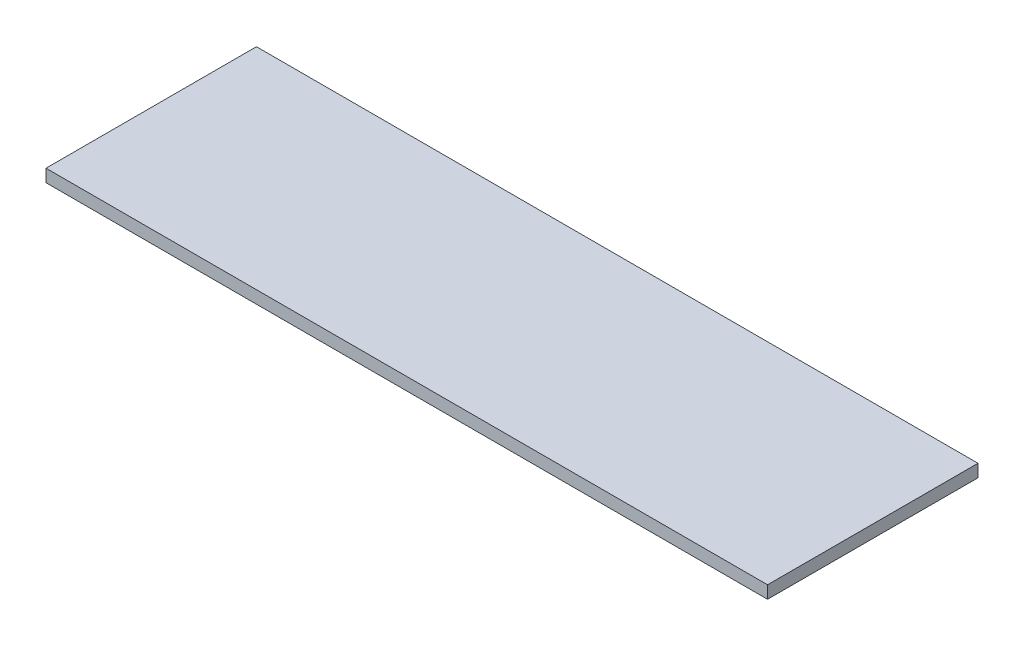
ISO-10303-21;
HEADER;
FILE_DESCRIPTION(('STEP AP214'),'2;1');
FILE_NAME('part.step','',(''),(''),'','','');
FILE_SCHEMA(('AUTOMOTIVE_DESIGN { 1 0 10303 214 1 1 1 1 }'));
ENDSEC;
DATA;
#1=APPLICATION_CONTEXT('core data for automotive mechanical design processes');
#2=APPLICATION_PROTOCOL_DEFINITION('international standard','automotive_design',2000,#1);
#3=PRODUCT_CONTEXT('',#1,'mechanical');
#4=PRODUCT('Part','Part','',(#3));
#5=PRODUCT_RELATED_PRODUCT_CATEGORY('part','',(#4));
#6=PRODUCT_DEFINITION_FORMATION('','',#4);
#7=PRODUCT_DEFINITION_CONTEXT('part definition',#1,'design');
#8=PRODUCT_DEFINITION('design','',#6,#7);
#9=PRODUCT_DEFINITION_SHAPE('','',#8);
#10=(LENGTH_UNIT() NAMED_UNIT(*) SI_UNIT(.MILLI.,.METRE.));
#11=(NAMED_UNIT(*) PLANE_ANGLE_UNIT() SI_UNIT($,.RADIAN.));
#12=(NAMED_UNIT(*) SI_UNIT($,.STERADIAN.) SOLID_ANGLE_UNIT());
#13=UNCERTAINTY_MEASURE_WITH_UNIT(LENGTH_MEASURE(1.E-05),#10,'distance_accuracy_value','');
#14=(GEOMETRIC_REPRESENTATION_CONTEXT(3) GLOBAL_UNCERTAINTY_ASSIGNED_CONTEXT((#13)) GLOBAL_UNIT_ASSIGNED_CONTEXT((#10,
#11,#12)) REPRESENTATION_CONTEXT('',''));
#15=CARTESIAN_POINT('',(0.,0.,0.));
#16=DIRECTION('',(0.,0.,1.));
#17=DIRECTION('',(1.,0.,0.));
#18=AXIS2_PLACEMENT_3D('',#15,#16,#17);
#19=CARTESIAN_POINT('',(-76.2,2.65684,-22.225));
#20=DIRECTION('',(1.,0.,0.));
#21=DIRECTION('',(0.,0.,-1.));
#22=AXIS2_PLACEMENT_3D('',#19,#20,#21);
#23=PLANE('',#22);
#24=DIRECTION('',(0.,0.,1.));
#25=VECTOR('',#24,1.);
#26=CARTESIAN_POINT('',(-76.2,0.,-22.225));
#27=LINE('',#26,#25);
#28=CARTESIAN_POINT('',(-76.2,0.,-22.225));
#29=VERTEX_POINT('',#28);
#30=CARTESIAN_POINT('',(-76.2,0.,22.225));
#31=VERTEX_POINT('',#30);
#32=EDGE_CURVE('E96',#29,#31,#27,.T.);
#33=ORIENTED_EDGE('',*,*,#32,.T.);
#34=DIRECTION('',(0.,-1.,0.));
#35=VECTOR('',#34,1.);
#36=CARTESIAN_POINT('',(-76.2,2.65684,22.225));
#37=LINE('',#36,#35);
#38=CARTESIAN_POINT('',(-76.2,2.65684,22.225));
#39=VERTEX_POINT('',#38);
#40=EDGE_CURVE('E11',#39,#31,#37,.T.);
#41=ORIENTED_EDGE('',*,*,#40,.F.);
#42=DIRECTION('',(0.,0.,1.));
#43=VECTOR('',#42,1.);
#44=CARTESIAN_POINT('',(-76.2,2.65684,-22.225));
#45=LINE('',#44,#43);
#46=CARTESIAN_POINT('',(-76.2,2.65684,-22.225));
#47=VERTEX_POINT('',#46);
#48=EDGE_CURVE('E84',#47,#39,#45,.T.);
#49=ORIENTED_EDGE('',*,*,#48,.F.);
#50=DIRECTION('',(0.,-1.,0.));
#51=VECTOR('',#50,1.);
#52=CARTESIAN_POINT('',(-76.2,2.65684,-22.225));
#53=LINE('',#52,#51);
#54=EDGE_CURVE('E92',#47,#29,#53,.T.);
#55=ORIENTED_EDGE('',*,*,#54,.T.);
#56=EDGE_LOOP('',(#33,#41,#49,#55));
#57=FACE_BOUND('',#56,.T.);
#58=ADVANCED_FACE('F33',(#57),#23,.F.);
#59=CARTESIAN_POINT('',(-76.2,2.65684,22.225));
#60=DIRECTION('',(0.,0.,-1.));
#61=DIRECTION('',(-1.,0.,0.));
#62=AXIS2_PLACEMENT_3D('',#59,#60,#61);
#63=PLANE('',#62);
#64=DIRECTION('',(1.,0.,0.));
#65=VECTOR('',#64,1.);
#66=CARTESIAN_POINT('',(-76.2,0.,22.225));
#67=LINE('',#66,#65);
#68=CARTESIAN_POINT('',(76.2,0.,22.225));
#69=VERTEX_POINT('',#68);
#70=EDGE_CURVE('E88',#31,#69,#67,.T.);
#71=ORIENTED_EDGE('',*,*,#70,.T.);
#72=DIRECTION('',(0.,-1.,0.));
#73=VECTOR('',#72,1.);
#74=CARTESIAN_POINT('',(76.2,2.65684,22.225));
#75=LINE('',#74,#73);
#76=CARTESIAN_POINT('',(76.2,2.65684,22.225));
#77=VERTEX_POINT('',#76);
#78=EDGE_CURVE('E41',#77,#69,#75,.T.);
#79=ORIENTED_EDGE('',*,*,#78,.F.);
#80=DIRECTION('',(1.,0.,0.));
#81=VECTOR('',#80,1.);
#82=CARTESIAN_POINT('',(-76.2,2.65684,22.225));
#83=LINE('',#82,#81);
#84=EDGE_CURVE('E79',#39,#77,#83,.T.);
#85=ORIENTED_EDGE('',*,*,#84,.F.);
#86=ORIENTED_EDGE('',*,*,#40,.T.);
#87=EDGE_LOOP('',(#71,#79,#85,#86));
#88=FACE_BOUND('',#87,.T.);
#89=ADVANCED_FACE('F87',(#88),#63,.F.);
#90=CARTESIAN_POINT('',(76.2,2.65684,-22.225));
#91=DIRECTION('',(-1.,0.,0.));
#92=DIRECTION('',(0.,0.,1.));
#93=AXIS2_PLACEMENT_3D('',#90,#91,#92);
#94=PLANE('',#93);
#95=DIRECTION('',(0.,0.,-1.));
#96=VECTOR('',#95,1.);
#97=CARTESIAN_POINT('',(76.2,0.,-22.225));
#98=LINE('',#97,#96);
#99=CARTESIAN_POINT('',(76.2,0.,-22.225));
#100=VERTEX_POINT('',#99);
#101=EDGE_CURVE('E66',#69,#100,#98,.T.);
#102=ORIENTED_EDGE('',*,*,#101,.T.);
#103=DIRECTION('',(0.,-1.,0.));
#104=VECTOR('',#103,1.);
#105=CARTESIAN_POINT('',(76.2,2.65684,-22.225));
#106=LINE('',#105,#104);
#107=CARTESIAN_POINT('',(76.2,2.65684,-22.225));
#108=VERTEX_POINT('',#107);
#109=EDGE_CURVE('E89',#108,#100,#106,.T.);
#110=ORIENTED_EDGE('',*,*,#109,.F.);
#111=DIRECTION('',(0.,0.,-1.));
#112=VECTOR('',#111,1.);
#113=CARTESIAN_POINT('',(76.2,2.65684,-22.225));
#114=LINE('',#113,#112);
#115=EDGE_CURVE('E82',#77,#108,#114,.T.);
#116=ORIENTED_EDGE('',*,*,#115,.F.);
#117=ORIENTED_EDGE('',*,*,#78,.T.);
#118=EDGE_LOOP('',(#102,#110,#116,#117));
#119=FACE_BOUND('',#118,.T.);
#120=ADVANCED_FACE('F90',(#119),#94,.F.);
#121=CARTESIAN_POINT('',(-76.2,2.65684,-22.225));
#122=DIRECTION('',(0.,0.,1.));
#123=DIRECTION('',(1.,0.,0.));
#124=AXIS2_PLACEMENT_3D('',#121,#122,#123);
#125=PLANE('',#124);
#126=DIRECTION('',(-1.,0.,0.));
#127=VECTOR('',#126,1.);
#128=CARTESIAN_POINT('',(-76.2,0.,-22.225));
#129=LINE('',#128,#127);
#130=EDGE_CURVE('E72',#100,#29,#129,.T.);
#131=ORIENTED_EDGE('',*,*,#130,.T.);
#132=ORIENTED_EDGE('',*,*,#54,.F.);
#133=DIRECTION('',(-1.,0.,0.));
#134=VECTOR('',#133,1.);
#135=CARTESIAN_POINT('',(-76.2,2.65684,-22.225));
#136=LINE('',#135,#134);
#137=EDGE_CURVE('E49',#108,#47,#136,.T.);
#138=ORIENTED_EDGE('',*,*,#137,.F.);
#139=ORIENTED_EDGE('',*,*,#109,.T.);
#140=EDGE_LOOP('',(#131,#132,#138,#139));
#141=FACE_BOUND('',#140,.T.);
#142=ADVANCED_FACE('F103',(#141),#125,.F.);
#143=CARTESIAN_POINT('',(0.,2.65684,0.));
#144=DIRECTION('',(0.,1.,0.));
#145=DIRECTION('',(0.,0.,1.));
#146=AXIS2_PLACEMENT_3D('',#143,#144,#145);
#147=PLANE('',#146);
#148=ORIENTED_EDGE('',*,*,#48,.T.);
#149=ORIENTED_EDGE('',*,*,#84,.T.);
#150=ORIENTED_EDGE('',*,*,#115,.T.);
#151=ORIENTED_EDGE('',*,*,#137,.T.);
#152=EDGE_LOOP('',(#148,#149,#150,#151));
#153=FACE_BOUND('',#152,.T.);
#154=ADVANCED_FACE('F80',(#153),#147,.T.);
#155=CARTESIAN_POINT('',(0.,0.,0.));
#156=DIRECTION('',(0.,1.,0.));
#157=DIRECTION('',(0.,0.,1.));
#158=AXIS2_PLACEMENT_3D('',#155,#156,#157);
#159=PLANE('',#158);
#160=ORIENTED_EDGE('',*,*,#32,.F.);
#161=ORIENTED_EDGE('',*,*,#130,.F.);
#162=ORIENTED_EDGE('',*,*,#101,.F.);
#163=ORIENTED_EDGE('',*,*,#70,.F.);
#164=EDGE_LOOP('',(#160,#161,#162,#163));
#165=FACE_BOUND('',#164,.T.);
#166=ADVANCED_FACE('F106',(#165),#159,.F.);
#167=CLOSED_SHELL('',(#58,#89,#120,#142,#154,#166));
#168=MANIFOLD_SOLID_BREP('B2',#167);
#169=ADVANCED_BREP_SHAPE_REPRESENTATION('',(#18,#168),#14);
#170=SHAPE_DEFINITION_REPRESENTATION(#9,#169);
ENDSEC;
END-ISO-10303-21;
